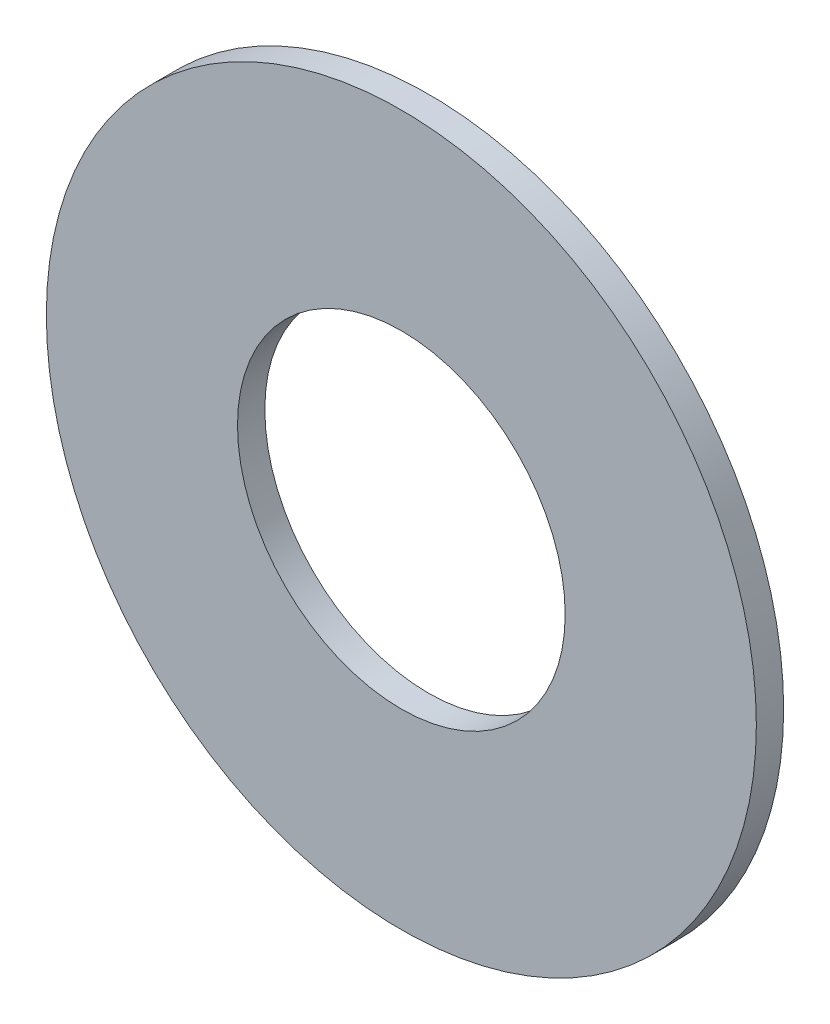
from build123d import *

# Parameters (mm, degrees)
ESQUISSE1_R      = 6.5
ESQUISSE1_R_2    = 3
EXTRUSION1_DEPTH = 0.5


with BuildPart() as part:
    # Esquisse1 → Extrusion1 (new body)
    with BuildSketch(Plane.XY):
        Circle(ESQUISSE1_R)
        Circle(ESQUISSE1_R_2, mode=Mode.SUBTRACT)
    extrude(amount=EXTRUSION1_DEPTH)


solid = part.part
